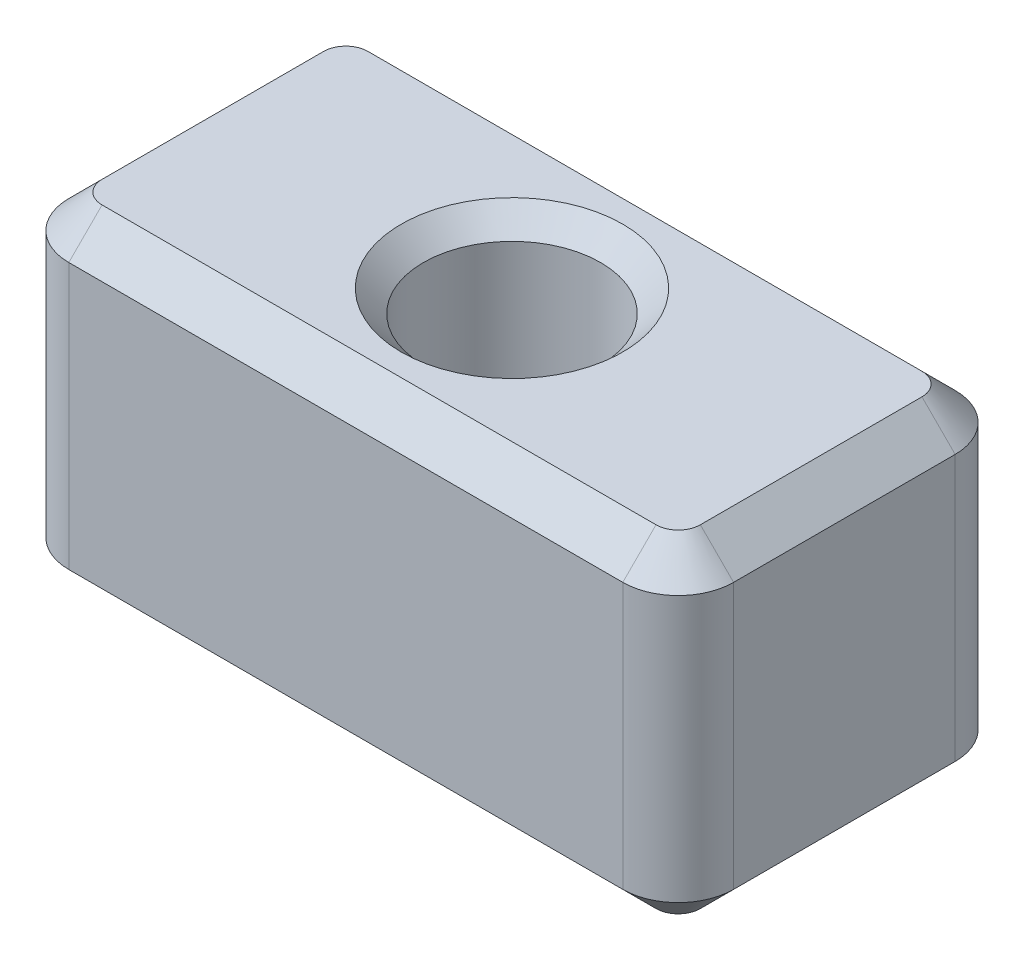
ISO-10303-21;
HEADER;
FILE_DESCRIPTION(('STEP AP214'),'2;1');
FILE_NAME('part.step','',(''),(''),'','','');
FILE_SCHEMA(('AUTOMOTIVE_DESIGN { 1 0 10303 214 1 1 1 1 }'));
ENDSEC;
DATA;
#1=APPLICATION_CONTEXT('core data for automotive mechanical design processes');
#2=APPLICATION_PROTOCOL_DEFINITION('international standard','automotive_design',2000,#1);
#3=PRODUCT_CONTEXT('',#1,'mechanical');
#4=PRODUCT('Part','Part','',(#3));
#5=PRODUCT_RELATED_PRODUCT_CATEGORY('part','',(#4));
#6=PRODUCT_DEFINITION_FORMATION('','',#4);
#7=PRODUCT_DEFINITION_CONTEXT('part definition',#1,'design');
#8=PRODUCT_DEFINITION('design','',#6,#7);
#9=PRODUCT_DEFINITION_SHAPE('','',#8);
#10=(LENGTH_UNIT() NAMED_UNIT(*) SI_UNIT(.MILLI.,.METRE.));
#11=(NAMED_UNIT(*) PLANE_ANGLE_UNIT() SI_UNIT($,.RADIAN.));
#12=(NAMED_UNIT(*) SI_UNIT($,.STERADIAN.) SOLID_ANGLE_UNIT());
#13=UNCERTAINTY_MEASURE_WITH_UNIT(LENGTH_MEASURE(1.E-05),#10,'distance_accuracy_value','');
#14=(GEOMETRIC_REPRESENTATION_CONTEXT(3) GLOBAL_UNCERTAINTY_ASSIGNED_CONTEXT((#13)) GLOBAL_UNIT_ASSIGNED_CONTEXT((#10,
#11,#12)) REPRESENTATION_CONTEXT('',''));
#15=CARTESIAN_POINT('',(0.,0.,0.));
#16=DIRECTION('',(0.,0.,1.));
#17=DIRECTION('',(1.,0.,0.));
#18=AXIS2_PLACEMENT_3D('',#15,#16,#17);
#19=CARTESIAN_POINT('',(53.,-5.4,0.15));
#20=DIRECTION('',(-1.,0.,0.));
#21=DIRECTION('',(0.,0.,1.));
#22=AXIS2_PLACEMENT_3D('',#19,#20,#21);
#23=PLANE('',#22);
#24=DIRECTION('',(0.,1.,0.));
#25=VECTOR('',#24,1.);
#26=CARTESIAN_POINT('',(53.,-5.4,2.65));
#27=LINE('',#26,#25);
#28=CARTESIAN_POINT('',(53.,-5.1,2.65));
#29=VERTEX_POINT('',#28);
#30=CARTESIAN_POINT('',(53.,-2.70000000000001,2.65));
#31=VERTEX_POINT('',#30);
#32=EDGE_CURVE('E560',#29,#31,#27,.T.);
#33=ORIENTED_EDGE('',*,*,#32,.T.);
#34=DIRECTION('',(0.,0.,-1.));
#35=VECTOR('',#34,1.);
#36=CARTESIAN_POINT('',(53.,-2.70000000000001,0.15));
#37=LINE('',#36,#35);
#38=CARTESIAN_POINT('',(53.,-2.70000000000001,0.65));
#39=VERTEX_POINT('',#38);
#40=EDGE_CURVE('E519',#31,#39,#37,.T.);
#41=ORIENTED_EDGE('',*,*,#40,.T.);
#42=DIRECTION('',(0.,1.,0.));
#43=VECTOR('',#42,1.);
#44=CARTESIAN_POINT('',(53.,-5.4,0.65));
#45=LINE('',#44,#43);
#46=CARTESIAN_POINT('',(53.,-5.1,0.65));
#47=VERTEX_POINT('',#46);
#48=EDGE_CURVE('E551',#39,#47,#45,.F.);
#49=ORIENTED_EDGE('',*,*,#48,.T.);
#50=DIRECTION('',(0.,0.,1.));
#51=VECTOR('',#50,1.);
#52=CARTESIAN_POINT('',(53.,-5.1,2.65));
#53=LINE('',#52,#51);
#54=EDGE_CURVE('E510',#47,#29,#53,.T.);
#55=ORIENTED_EDGE('',*,*,#54,.T.);
#56=EDGE_LOOP('',(#33,#41,#49,#55));
#57=FACE_BOUND('',#56,.T.);
#58=ADVANCED_FACE('F222',(#57),#23,.T.);
#59=CARTESIAN_POINT('',(53.,-5.4,0.15));
#60=DIRECTION('',(0.,0.,-1.));
#61=DIRECTION('',(-1.,0.,0.));
#62=AXIS2_PLACEMENT_3D('',#59,#60,#61);
#63=PLANE('',#62);
#64=DIRECTION('',(0.,1.,0.));
#65=VECTOR('',#64,1.);
#66=CARTESIAN_POINT('',(53.5,-5.4,0.15));
#67=LINE('',#66,#65);
#68=CARTESIAN_POINT('',(53.5,-5.1,0.15));
#69=VERTEX_POINT('',#68);
#70=CARTESIAN_POINT('',(53.5,-2.70000000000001,0.15));
#71=VERTEX_POINT('',#70);
#72=EDGE_CURVE('E515',#69,#71,#67,.T.);
#73=ORIENTED_EDGE('',*,*,#72,.T.);
#74=DIRECTION('',(1.,0.,0.));
#75=VECTOR('',#74,1.);
#76=CARTESIAN_POINT('',(53.,-2.70000000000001,0.15));
#77=LINE('',#76,#75);
#78=CARTESIAN_POINT('',(58.5,-2.70000000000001,0.15));
#79=VERTEX_POINT('',#78);
#80=EDGE_CURVE('E457',#71,#79,#77,.T.);
#81=ORIENTED_EDGE('',*,*,#80,.T.);
#82=DIRECTION('',(0.,1.,0.));
#83=VECTOR('',#82,1.);
#84=CARTESIAN_POINT('',(58.5,-5.4,0.15));
#85=LINE('',#84,#83);
#86=CARTESIAN_POINT('',(58.5,-5.1,0.15));
#87=VERTEX_POINT('',#86);
#88=EDGE_CURVE('E513',#79,#87,#85,.F.);
#89=ORIENTED_EDGE('',*,*,#88,.T.);
#90=DIRECTION('',(-1.,0.,0.));
#91=VECTOR('',#90,1.);
#92=CARTESIAN_POINT('',(53.5,-5.1,0.15));
#93=LINE('',#92,#91);
#94=EDGE_CURVE('E452',#87,#69,#93,.T.);
#95=ORIENTED_EDGE('',*,*,#94,.T.);
#96=EDGE_LOOP('',(#73,#81,#89,#95));
#97=FACE_BOUND('',#96,.T.);
#98=ADVANCED_FACE('F556',(#97),#63,.T.);
#99=CARTESIAN_POINT('',(59.,-5.4,0.15));
#100=DIRECTION('',(1.,0.,0.));
#101=DIRECTION('',(0.,0.,-1.));
#102=AXIS2_PLACEMENT_3D('',#99,#100,#101);
#103=PLANE('',#102);
#104=DIRECTION('',(0.,1.,0.));
#105=VECTOR('',#104,1.);
#106=CARTESIAN_POINT('',(59.,-5.4,0.65));
#107=LINE('',#106,#105);
#108=CARTESIAN_POINT('',(59.,-5.1,0.65));
#109=VERTEX_POINT('',#108);
#110=CARTESIAN_POINT('',(59.,-2.70000000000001,0.65));
#111=VERTEX_POINT('',#110);
#112=EDGE_CURVE('E504',#109,#111,#107,.T.);
#113=ORIENTED_EDGE('',*,*,#112,.T.);
#114=DIRECTION('',(0.,0.,1.));
#115=VECTOR('',#114,1.);
#116=CARTESIAN_POINT('',(59.,-2.70000000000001,0.15));
#117=LINE('',#116,#115);
#118=CARTESIAN_POINT('',(59.,-2.70000000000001,2.65));
#119=VERTEX_POINT('',#118);
#120=EDGE_CURVE('E478',#111,#119,#117,.T.);
#121=ORIENTED_EDGE('',*,*,#120,.T.);
#122=DIRECTION('',(0.,1.,0.));
#123=VECTOR('',#122,1.);
#124=CARTESIAN_POINT('',(59.,-5.4,2.65));
#125=LINE('',#124,#123);
#126=CARTESIAN_POINT('',(59.,-5.1,2.65));
#127=VERTEX_POINT('',#126);
#128=EDGE_CURVE('E582',#119,#127,#125,.F.);
#129=ORIENTED_EDGE('',*,*,#128,.T.);
#130=DIRECTION('',(0.,0.,-1.));
#131=VECTOR('',#130,1.);
#132=CARTESIAN_POINT('',(59.,-5.1,0.65));
#133=LINE('',#132,#131);
#134=EDGE_CURVE('E476',#127,#109,#133,.T.);
#135=ORIENTED_EDGE('',*,*,#134,.T.);
#136=EDGE_LOOP('',(#113,#121,#129,#135));
#137=FACE_BOUND('',#136,.T.);
#138=ADVANCED_FACE('F577',(#137),#103,.T.);
#139=CARTESIAN_POINT('',(53.,-5.4,3.15));
#140=DIRECTION('',(0.,0.,1.));
#141=DIRECTION('',(1.,0.,0.));
#142=AXIS2_PLACEMENT_3D('',#139,#140,#141);
#143=PLANE('',#142);
#144=DIRECTION('',(0.,1.,0.));
#145=VECTOR('',#144,1.);
#146=CARTESIAN_POINT('',(58.5,-5.4,3.15));
#147=LINE('',#146,#145);
#148=CARTESIAN_POINT('',(58.5,-5.1,3.15));
#149=VERTEX_POINT('',#148);
#150=CARTESIAN_POINT('',(58.5,-2.70000000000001,3.15));
#151=VERTEX_POINT('',#150);
#152=EDGE_CURVE('E503',#149,#151,#147,.T.);
#153=ORIENTED_EDGE('',*,*,#152,.T.);
#154=DIRECTION('',(-1.,0.,0.));
#155=VECTOR('',#154,1.);
#156=CARTESIAN_POINT('',(53.,-2.70000000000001,3.15));
#157=LINE('',#156,#155);
#158=CARTESIAN_POINT('',(53.5,-2.70000000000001,3.15));
#159=VERTEX_POINT('',#158);
#160=EDGE_CURVE('E445',#151,#159,#157,.T.);
#161=ORIENTED_EDGE('',*,*,#160,.T.);
#162=DIRECTION('',(0.,1.,0.));
#163=VECTOR('',#162,1.);
#164=CARTESIAN_POINT('',(53.5,-5.4,3.15));
#165=LINE('',#164,#163);
#166=CARTESIAN_POINT('',(53.5,-5.1,3.15));
#167=VERTEX_POINT('',#166);
#168=EDGE_CURVE('E363',#159,#167,#165,.F.);
#169=ORIENTED_EDGE('',*,*,#168,.T.);
#170=DIRECTION('',(1.,0.,0.));
#171=VECTOR('',#170,1.);
#172=CARTESIAN_POINT('',(58.5,-5.1,3.15));
#173=LINE('',#172,#171);
#174=EDGE_CURVE('E453',#167,#149,#173,.T.);
#175=ORIENTED_EDGE('',*,*,#174,.T.);
#176=EDGE_LOOP('',(#153,#161,#169,#175));
#177=FACE_BOUND('',#176,.T.);
#178=ADVANCED_FACE('F623',(#177),#143,.T.);
#179=CARTESIAN_POINT('',(0.,-5.4,0.));
#180=DIRECTION('',(0.,1.,0.));
#181=DIRECTION('',(0.,0.,1.));
#182=AXIS2_PLACEMENT_3D('',#179,#180,#181);
#183=PLANE('',#182);
#184=CARTESIAN_POINT('',(53.5,-5.4,2.65));
#185=DIRECTION('',(0.,1.,0.));
#186=DIRECTION('',(0.,0.,1.));
#187=AXIS2_PLACEMENT_3D('',#184,#185,#186);
#188=CIRCLE('',#187,0.199999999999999);
#189=CARTESIAN_POINT('',(53.5,-5.4,2.85));
#190=VERTEX_POINT('',#189);
#191=CARTESIAN_POINT('',(53.3,-5.4,2.65));
#192=VERTEX_POINT('',#191);
#193=EDGE_CURVE('E232',#190,#192,#188,.F.);
#194=ORIENTED_EDGE('',*,*,#193,.T.);
#195=DIRECTION('',(0.,0.,-1.));
#196=VECTOR('',#195,1.);
#197=CARTESIAN_POINT('',(53.3,-5.4,0.65));
#198=LINE('',#197,#196);
#199=CARTESIAN_POINT('',(53.3,-5.4,0.65));
#200=VERTEX_POINT('',#199);
#201=EDGE_CURVE('E14',#192,#200,#198,.T.);
#202=ORIENTED_EDGE('',*,*,#201,.T.);
#203=CARTESIAN_POINT('',(53.5,-5.4,0.65));
#204=DIRECTION('',(0.,1.,0.));
#205=DIRECTION('',(0.,0.,1.));
#206=AXIS2_PLACEMENT_3D('',#203,#204,#205);
#207=CIRCLE('',#206,0.199999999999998);
#208=CARTESIAN_POINT('',(53.5,-5.4,0.450000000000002));
#209=VERTEX_POINT('',#208);
#210=EDGE_CURVE('E495',#200,#209,#207,.F.);
#211=ORIENTED_EDGE('',*,*,#210,.T.);
#212=DIRECTION('',(1.,0.,0.));
#213=VECTOR('',#212,1.);
#214=CARTESIAN_POINT('',(58.5,-5.4,0.450000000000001));
#215=LINE('',#214,#213);
#216=CARTESIAN_POINT('',(58.5,-5.4,0.450000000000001));
#217=VERTEX_POINT('',#216);
#218=EDGE_CURVE('E489',#209,#217,#215,.T.);
#219=ORIENTED_EDGE('',*,*,#218,.T.);
#220=CARTESIAN_POINT('',(58.5,-5.4,0.65));
#221=DIRECTION('',(0.,1.,0.));
#222=DIRECTION('',(0.,0.,1.));
#223=AXIS2_PLACEMENT_3D('',#220,#221,#222);
#224=CIRCLE('',#223,0.199999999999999);
#225=CARTESIAN_POINT('',(58.7,-5.4,0.65));
#226=VERTEX_POINT('',#225);
#227=EDGE_CURVE('E484',#217,#226,#224,.F.);
#228=ORIENTED_EDGE('',*,*,#227,.T.);
#229=DIRECTION('',(0.,0.,1.));
#230=VECTOR('',#229,1.);
#231=CARTESIAN_POINT('',(58.7,-5.4,2.65));
#232=LINE('',#231,#230);
#233=CARTESIAN_POINT('',(58.7,-5.4,2.65));
#234=VERTEX_POINT('',#233);
#235=EDGE_CURVE('E481',#226,#234,#232,.T.);
#236=ORIENTED_EDGE('',*,*,#235,.T.);
#237=CARTESIAN_POINT('',(58.5,-5.4,2.65));
#238=DIRECTION('',(0.,1.,0.));
#239=DIRECTION('',(0.,0.,1.));
#240=AXIS2_PLACEMENT_3D('',#237,#238,#239);
#241=CIRCLE('',#240,0.199999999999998);
#242=CARTESIAN_POINT('',(58.5,-5.4,2.85));
#243=VERTEX_POINT('',#242);
#244=EDGE_CURVE('E487',#234,#243,#241,.F.);
#245=ORIENTED_EDGE('',*,*,#244,.T.);
#246=DIRECTION('',(-1.,0.,0.));
#247=VECTOR('',#246,1.);
#248=CARTESIAN_POINT('',(53.5,-5.4,2.85));
#249=LINE('',#248,#247);
#250=EDGE_CURVE('E492',#243,#190,#249,.T.);
#251=ORIENTED_EDGE('',*,*,#250,.T.);
#252=EDGE_LOOP('',(#194,#202,#211,#219,#228,#236,#245,#251));
#253=FACE_BOUND('',#252,.T.);
#254=CARTESIAN_POINT('',(56.,-5.4,1.65));
#255=DIRECTION('',(0.,-1.,0.));
#256=DIRECTION('',(0.,0.,-1.));
#257=AXIS2_PLACEMENT_3D('',#254,#255,#256);
#258=CIRCLE('',#257,1.);
#259=CARTESIAN_POINT('',(56.,-5.4,0.649999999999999));
#260=VERTEX_POINT('',#259);
#261=EDGE_CURVE('E597',#260,#260,#258,.T.);
#262=ORIENTED_EDGE('',*,*,#261,.F.);
#263=EDGE_LOOP('',(#262));
#264=FACE_BOUND('',#263,.T.);
#265=ADVANCED_FACE('F621',(#253,#264),#183,.F.);
#266=CARTESIAN_POINT('',(0.,-2.4,0.));
#267=DIRECTION('',(0.,1.,0.));
#268=DIRECTION('',(0.,0.,1.));
#269=AXIS2_PLACEMENT_3D('',#266,#267,#268);
#270=PLANE('',#269);
#271=CARTESIAN_POINT('',(53.5,-2.4,0.65));
#272=DIRECTION('',(0.,1.,0.));
#273=DIRECTION('',(0.,0.,1.));
#274=AXIS2_PLACEMENT_3D('',#271,#272,#273);
#275=CIRCLE('',#274,0.199999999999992);
#276=CARTESIAN_POINT('',(53.5,-2.4,0.450000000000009));
#277=VERTEX_POINT('',#276);
#278=CARTESIAN_POINT('',(53.3,-2.4,0.65));
#279=VERTEX_POINT('',#278);
#280=EDGE_CURVE('E531',#277,#279,#275,.T.);
#281=ORIENTED_EDGE('',*,*,#280,.T.);
#282=DIRECTION('',(0.,0.,1.));
#283=VECTOR('',#282,1.);
#284=CARTESIAN_POINT('',(53.3,-2.4,0.));
#285=LINE('',#284,#283);
#286=CARTESIAN_POINT('',(53.3,-2.4,2.65));
#287=VERTEX_POINT('',#286);
#288=EDGE_CURVE('E507',#279,#287,#285,.T.);
#289=ORIENTED_EDGE('',*,*,#288,.T.);
#290=CARTESIAN_POINT('',(53.5,-2.4,2.65));
#291=DIRECTION('',(0.,1.,0.));
#292=DIRECTION('',(0.,0.,1.));
#293=AXIS2_PLACEMENT_3D('',#290,#291,#292);
#294=CIRCLE('',#293,0.199999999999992);
#295=CARTESIAN_POINT('',(53.5,-2.4,2.84999999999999));
#296=VERTEX_POINT('',#295);
#297=EDGE_CURVE('E511',#287,#296,#294,.T.);
#298=ORIENTED_EDGE('',*,*,#297,.T.);
#299=DIRECTION('',(1.,0.,0.));
#300=VECTOR('',#299,1.);
#301=CARTESIAN_POINT('',(0.,-2.4,2.85));
#302=LINE('',#301,#300);
#303=CARTESIAN_POINT('',(58.5,-2.4,2.84999999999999));
#304=VERTEX_POINT('',#303);
#305=EDGE_CURVE('E344',#296,#304,#302,.T.);
#306=ORIENTED_EDGE('',*,*,#305,.T.);
#307=CARTESIAN_POINT('',(58.5,-2.4,2.65));
#308=DIRECTION('',(0.,1.,0.));
#309=DIRECTION('',(0.,0.,1.));
#310=AXIS2_PLACEMENT_3D('',#307,#308,#309);
#311=CIRCLE('',#310,0.199999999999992);
#312=CARTESIAN_POINT('',(58.7,-2.4,2.65));
#313=VERTEX_POINT('',#312);
#314=EDGE_CURVE('E337',#304,#313,#311,.T.);
#315=ORIENTED_EDGE('',*,*,#314,.T.);
#316=DIRECTION('',(0.,0.,-1.));
#317=VECTOR('',#316,1.);
#318=CARTESIAN_POINT('',(58.7,-2.4,0.));
#319=LINE('',#318,#317);
#320=CARTESIAN_POINT('',(58.7,-2.4,0.65));
#321=VERTEX_POINT('',#320);
#322=EDGE_CURVE('E341',#313,#321,#319,.T.);
#323=ORIENTED_EDGE('',*,*,#322,.T.);
#324=CARTESIAN_POINT('',(58.5,-2.4,0.65));
#325=DIRECTION('',(0.,1.,0.));
#326=DIRECTION('',(0.,0.,1.));
#327=AXIS2_PLACEMENT_3D('',#324,#325,#326);
#328=CIRCLE('',#327,0.199999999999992);
#329=CARTESIAN_POINT('',(58.5,-2.4,0.450000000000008));
#330=VERTEX_POINT('',#329);
#331=EDGE_CURVE('E351',#321,#330,#328,.T.);
#332=ORIENTED_EDGE('',*,*,#331,.T.);
#333=DIRECTION('',(-1.,0.,0.));
#334=VECTOR('',#333,1.);
#335=CARTESIAN_POINT('',(0.,-2.4,0.450000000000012));
#336=LINE('',#335,#334);
#337=EDGE_CURVE('E350',#330,#277,#336,.T.);
#338=ORIENTED_EDGE('',*,*,#337,.T.);
#339=EDGE_LOOP('',(#281,#289,#298,#306,#315,#323,#332,#338));
#340=FACE_BOUND('',#339,.T.);
#341=CARTESIAN_POINT('',(56.,-2.4,1.65));
#342=DIRECTION('',(0.,-1.,0.));
#343=DIRECTION('',(0.,0.,-1.));
#344=AXIS2_PLACEMENT_3D('',#341,#342,#343);
#345=CIRCLE('',#344,1.);
#346=CARTESIAN_POINT('',(56.,-2.4,0.649999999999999));
#347=VERTEX_POINT('',#346);
#348=EDGE_CURVE('E373',#347,#347,#345,.T.);
#349=ORIENTED_EDGE('',*,*,#348,.T.);
#350=EDGE_LOOP('',(#349));
#351=FACE_BOUND('',#350,.T.);
#352=ADVANCED_FACE('F339',(#340,#351),#270,.T.);
#353=CARTESIAN_POINT('',(56.,-2.6,1.65));
#354=DIRECTION('',(0.,1.,0.));
#355=DIRECTION('',(0.,0.,1.));
#356=AXIS2_PLACEMENT_3D('',#353,#354,#355);
#357=CONICAL_SURFACE('',#356,0.800000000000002,0.785398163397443);
#358=ORIENTED_EDGE('',*,*,#348,.F.);
#359=EDGE_LOOP('',(#358));
#360=FACE_BOUND('',#359,.T.);
#361=CARTESIAN_POINT('',(56.,-2.6,1.65));
#362=DIRECTION('',(0.,-1.,0.));
#363=DIRECTION('',(0.,0.,-1.));
#364=AXIS2_PLACEMENT_3D('',#361,#362,#363);
#365=CIRCLE('',#364,0.800000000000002);
#366=CARTESIAN_POINT('',(56.,-2.6,0.849999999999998));
#367=VERTEX_POINT('',#366);
#368=EDGE_CURVE('E516',#367,#367,#365,.T.);
#369=ORIENTED_EDGE('',*,*,#368,.T.);
#370=EDGE_LOOP('',(#369));
#371=FACE_BOUND('',#370,.T.);
#372=ADVANCED_FACE('F603',(#360,#371),#357,.F.);
#373=CARTESIAN_POINT('',(56.,-5.4,1.65));
#374=DIRECTION('',(0.,-1.,0.));
#375=DIRECTION('',(0.,0.,-1.));
#376=AXIS2_PLACEMENT_3D('',#373,#374,#375);
#377=CYLINDRICAL_SURFACE('',#376,0.800000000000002);
#378=ORIENTED_EDGE('',*,*,#368,.F.);
#379=EDGE_LOOP('',(#378));
#380=FACE_BOUND('',#379,.T.);
#381=CARTESIAN_POINT('',(56.,-5.2,1.65));
#382=DIRECTION('',(0.,-1.,0.));
#383=DIRECTION('',(0.,0.,-1.));
#384=AXIS2_PLACEMENT_3D('',#381,#382,#383);
#385=CIRCLE('',#384,0.800000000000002);
#386=CARTESIAN_POINT('',(56.,-5.2,0.849999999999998));
#387=VERTEX_POINT('',#386);
#388=EDGE_CURVE('E593',#387,#387,#385,.T.);
#389=ORIENTED_EDGE('',*,*,#388,.T.);
#390=EDGE_LOOP('',(#389));
#391=FACE_BOUND('',#390,.T.);
#392=ADVANCED_FACE('F606',(#380,#391),#377,.F.);
#393=CARTESIAN_POINT('',(56.,-5.4,1.65));
#394=DIRECTION('',(0.,-1.,0.));
#395=DIRECTION('',(0.,0.,-1.));
#396=AXIS2_PLACEMENT_3D('',#393,#394,#395);
#397=CONICAL_SURFACE('',#396,1.,0.785398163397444);
#398=ORIENTED_EDGE('',*,*,#388,.F.);
#399=EDGE_LOOP('',(#398));
#400=FACE_BOUND('',#399,.T.);
#401=ORIENTED_EDGE('',*,*,#261,.T.);
#402=EDGE_LOOP('',(#401));
#403=FACE_BOUND('',#402,.T.);
#404=ADVANCED_FACE('F612',(#400,#403),#397,.F.);
#405=CARTESIAN_POINT('',(53.5,-5.4,0.65));
#406=DIRECTION('',(0.,1.,0.));
#407=DIRECTION('',(0.,0.,1.));
#408=AXIS2_PLACEMENT_3D('',#405,#406,#407);
#409=CYLINDRICAL_SURFACE('',#408,0.5);
#410=ORIENTED_EDGE('',*,*,#48,.F.);
#411=CARTESIAN_POINT('',(53.5,-2.70000000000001,0.65));
#412=DIRECTION('',(0.,1.,0.));
#413=DIRECTION('',(0.,0.,1.));
#414=AXIS2_PLACEMENT_3D('',#411,#412,#413);
#415=CIRCLE('',#414,0.5);
#416=EDGE_CURVE('E460',#39,#71,#415,.F.);
#417=ORIENTED_EDGE('',*,*,#416,.T.);
#418=ORIENTED_EDGE('',*,*,#72,.F.);
#419=CARTESIAN_POINT('',(53.5,-5.1,0.65));
#420=DIRECTION('',(0.,1.,0.));
#421=DIRECTION('',(0.,0.,1.));
#422=AXIS2_PLACEMENT_3D('',#419,#420,#421);
#423=CIRCLE('',#422,0.5);
#424=EDGE_CURVE('E499',#69,#47,#423,.T.);
#425=ORIENTED_EDGE('',*,*,#424,.T.);
#426=EDGE_LOOP('',(#410,#417,#418,#425));
#427=FACE_BOUND('',#426,.T.);
#428=ADVANCED_FACE('F548',(#427),#409,.T.);
#429=CARTESIAN_POINT('',(58.5,-5.4,0.65));
#430=DIRECTION('',(0.,1.,0.));
#431=DIRECTION('',(0.,0.,1.));
#432=AXIS2_PLACEMENT_3D('',#429,#430,#431);
#433=CYLINDRICAL_SURFACE('',#432,0.5);
#434=ORIENTED_EDGE('',*,*,#88,.F.);
#435=CARTESIAN_POINT('',(58.5,-2.70000000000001,0.65));
#436=DIRECTION('',(0.,1.,0.));
#437=DIRECTION('',(0.,0.,1.));
#438=AXIS2_PLACEMENT_3D('',#435,#436,#437);
#439=CIRCLE('',#438,0.5);
#440=EDGE_CURVE('E473',#79,#111,#439,.F.);
#441=ORIENTED_EDGE('',*,*,#440,.T.);
#442=ORIENTED_EDGE('',*,*,#112,.F.);
#443=CARTESIAN_POINT('',(58.5,-5.1,0.65));
#444=DIRECTION('',(0.,1.,0.));
#445=DIRECTION('',(0.,0.,1.));
#446=AXIS2_PLACEMENT_3D('',#443,#444,#445);
#447=CIRCLE('',#446,0.5);
#448=EDGE_CURVE('E470',#109,#87,#447,.T.);
#449=ORIENTED_EDGE('',*,*,#448,.T.);
#450=EDGE_LOOP('',(#434,#441,#442,#449));
#451=FACE_BOUND('',#450,.T.);
#452=ADVANCED_FACE('F575',(#451),#433,.T.);
#453=CARTESIAN_POINT('',(53.5,-5.4,2.65));
#454=DIRECTION('',(0.,1.,0.));
#455=DIRECTION('',(0.,0.,1.));
#456=AXIS2_PLACEMENT_3D('',#453,#454,#455);
#457=CYLINDRICAL_SURFACE('',#456,0.5);
#458=ORIENTED_EDGE('',*,*,#168,.F.);
#459=CARTESIAN_POINT('',(53.5,-2.70000000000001,2.65));
#460=DIRECTION('',(0.,1.,0.));
#461=DIRECTION('',(0.,0.,1.));
#462=AXIS2_PLACEMENT_3D('',#459,#460,#461);
#463=CIRCLE('',#462,0.5);
#464=EDGE_CURVE('E498',#159,#31,#463,.F.);
#465=ORIENTED_EDGE('',*,*,#464,.T.);
#466=ORIENTED_EDGE('',*,*,#32,.F.);
#467=CARTESIAN_POINT('',(53.5,-5.1,2.65));
#468=DIRECTION('',(0.,1.,0.));
#469=DIRECTION('',(0.,0.,1.));
#470=AXIS2_PLACEMENT_3D('',#467,#468,#469);
#471=CIRCLE('',#470,0.5);
#472=EDGE_CURVE('E500',#29,#167,#471,.T.);
#473=ORIENTED_EDGE('',*,*,#472,.T.);
#474=EDGE_LOOP('',(#458,#465,#466,#473));
#475=FACE_BOUND('',#474,.T.);
#476=ADVANCED_FACE('F644',(#475),#457,.T.);
#477=CARTESIAN_POINT('',(58.5,-5.4,2.65));
#478=DIRECTION('',(0.,1.,0.));
#479=DIRECTION('',(0.,0.,1.));
#480=AXIS2_PLACEMENT_3D('',#477,#478,#479);
#481=CYLINDRICAL_SURFACE('',#480,0.5);
#482=ORIENTED_EDGE('',*,*,#128,.F.);
#483=CARTESIAN_POINT('',(58.5,-2.70000000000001,2.65));
#484=DIRECTION('',(0.,1.,0.));
#485=DIRECTION('',(0.,0.,1.));
#486=AXIS2_PLACEMENT_3D('',#483,#484,#485);
#487=CIRCLE('',#486,0.5);
#488=EDGE_CURVE('E366',#119,#151,#487,.F.);
#489=ORIENTED_EDGE('',*,*,#488,.T.);
#490=ORIENTED_EDGE('',*,*,#152,.F.);
#491=CARTESIAN_POINT('',(58.5,-5.1,2.65));
#492=DIRECTION('',(0.,1.,0.));
#493=DIRECTION('',(0.,0.,1.));
#494=AXIS2_PLACEMENT_3D('',#491,#492,#493);
#495=CIRCLE('',#494,0.5);
#496=EDGE_CURVE('E466',#149,#127,#495,.T.);
#497=ORIENTED_EDGE('',*,*,#496,.T.);
#498=EDGE_LOOP('',(#482,#489,#490,#497));
#499=FACE_BOUND('',#498,.T.);
#500=ADVANCED_FACE('F647',(#499),#481,.T.);
#501=CARTESIAN_POINT('',(58.7,-2.4,0.));
#502=DIRECTION('',(-0.707106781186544,-0.707106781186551,0.));
#503=DIRECTION('',(0.,0.,-1.));
#504=AXIS2_PLACEMENT_3D('',#501,#502,#503);
#505=PLANE('',#504);
#506=DIRECTION('',(-0.707106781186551,0.707106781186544,0.));
#507=VECTOR('',#506,1.);
#508=CARTESIAN_POINT('',(59.,-2.70000000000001,2.65));
#509=LINE('',#508,#507);
#510=EDGE_CURVE('E357',#119,#313,#509,.T.);
#511=ORIENTED_EDGE('',*,*,#510,.F.);
#512=ORIENTED_EDGE('',*,*,#120,.F.);
#513=DIRECTION('',(0.707106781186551,-0.707106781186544,0.));
#514=VECTOR('',#513,1.);
#515=CARTESIAN_POINT('',(58.7,-2.4,0.65));
#516=LINE('',#515,#514);
#517=EDGE_CURVE('E360',#321,#111,#516,.T.);
#518=ORIENTED_EDGE('',*,*,#517,.F.);
#519=ORIENTED_EDGE('',*,*,#322,.F.);
#520=EDGE_LOOP('',(#511,#512,#518,#519));
#521=FACE_BOUND('',#520,.T.);
#522=ADVANCED_FACE('F355',(#521),#505,.F.);
#523=CARTESIAN_POINT('',(58.5,-2.4,0.65));
#524=DIRECTION('',(0.,-1.,0.));
#525=DIRECTION('',(0.,0.,-1.));
#526=AXIS2_PLACEMENT_3D('',#523,#524,#525);
#527=CONICAL_SURFACE('',#526,0.199999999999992,0.785398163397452);
#528=ORIENTED_EDGE('',*,*,#517,.T.);
#529=ORIENTED_EDGE('',*,*,#440,.F.);
#530=DIRECTION('',(0.,-0.707106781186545,-0.70710678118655));
#531=VECTOR('',#530,1.);
#532=CARTESIAN_POINT('',(58.5,-2.4,0.450000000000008));
#533=LINE('',#532,#531);
#534=EDGE_CURVE('E368',#330,#79,#533,.T.);
#535=ORIENTED_EDGE('',*,*,#534,.F.);
#536=ORIENTED_EDGE('',*,*,#331,.F.);
#537=EDGE_LOOP('',(#528,#529,#535,#536));
#538=FACE_BOUND('',#537,.T.);
#539=ADVANCED_FACE('F571',(#538),#527,.T.);
#540=CARTESIAN_POINT('',(58.5,-2.4,2.65));
#541=DIRECTION('',(0.,-1.,0.));
#542=DIRECTION('',(0.,0.,-1.));
#543=AXIS2_PLACEMENT_3D('',#540,#541,#542);
#544=CONICAL_SURFACE('',#543,0.199999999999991,0.785398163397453);
#545=ORIENTED_EDGE('',*,*,#510,.T.);
#546=ORIENTED_EDGE('',*,*,#314,.F.);
#547=DIRECTION('',(0.,0.707106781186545,-0.70710678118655));
#548=VECTOR('',#547,1.);
#549=CARTESIAN_POINT('',(58.5,-2.70000000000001,3.15));
#550=LINE('',#549,#548);
#551=EDGE_CURVE('E377',#151,#304,#550,.T.);
#552=ORIENTED_EDGE('',*,*,#551,.F.);
#553=ORIENTED_EDGE('',*,*,#488,.F.);
#554=EDGE_LOOP('',(#545,#546,#552,#553));
#555=FACE_BOUND('',#554,.T.);
#556=ADVANCED_FACE('F365',(#555),#544,.T.);
#557=CARTESIAN_POINT('',(0.,-2.4,0.450000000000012));
#558=DIRECTION('',(0.,-0.707106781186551,0.707106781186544));
#559=DIRECTION('',(-1.,0.,0.));
#560=AXIS2_PLACEMENT_3D('',#557,#558,#559);
#561=PLANE('',#560);
#562=ORIENTED_EDGE('',*,*,#534,.T.);
#563=ORIENTED_EDGE('',*,*,#80,.F.);
#564=DIRECTION('',(0.,-0.707106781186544,-0.707106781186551));
#565=VECTOR('',#564,1.);
#566=CARTESIAN_POINT('',(53.5,-2.4,0.450000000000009));
#567=LINE('',#566,#565);
#568=EDGE_CURVE('E435',#277,#71,#567,.T.);
#569=ORIENTED_EDGE('',*,*,#568,.F.);
#570=ORIENTED_EDGE('',*,*,#337,.F.);
#571=EDGE_LOOP('',(#562,#563,#569,#570));
#572=FACE_BOUND('',#571,.T.);
#573=ADVANCED_FACE('F564',(#572),#561,.F.);
#574=CARTESIAN_POINT('',(0.,-2.4,2.85));
#575=DIRECTION('',(0.,-0.70710678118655,-0.707106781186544));
#576=DIRECTION('',(1.,0.,0.));
#577=AXIS2_PLACEMENT_3D('',#574,#575,#576);
#578=PLANE('',#577);
#579=ORIENTED_EDGE('',*,*,#551,.T.);
#580=ORIENTED_EDGE('',*,*,#305,.F.);
#581=DIRECTION('',(0.,0.707106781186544,-0.707106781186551));
#582=VECTOR('',#581,1.);
#583=CARTESIAN_POINT('',(53.5,-2.70000000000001,3.15));
#584=LINE('',#583,#582);
#585=EDGE_CURVE('E428',#159,#296,#584,.T.);
#586=ORIENTED_EDGE('',*,*,#585,.F.);
#587=ORIENTED_EDGE('',*,*,#160,.F.);
#588=EDGE_LOOP('',(#579,#580,#586,#587));
#589=FACE_BOUND('',#588,.T.);
#590=ADVANCED_FACE('F443',(#589),#578,.F.);
#591=CARTESIAN_POINT('',(53.5,-2.4,0.65));
#592=DIRECTION('',(0.,-1.,0.));
#593=DIRECTION('',(0.,0.,-1.));
#594=AXIS2_PLACEMENT_3D('',#591,#592,#593);
#595=CONICAL_SURFACE('',#594,0.199999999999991,0.785398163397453);
#596=ORIENTED_EDGE('',*,*,#568,.T.);
#597=ORIENTED_EDGE('',*,*,#416,.F.);
#598=DIRECTION('',(-0.707106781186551,-0.707106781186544,0.));
#599=VECTOR('',#598,1.);
#600=CARTESIAN_POINT('',(53.3,-2.4,0.65));
#601=LINE('',#600,#599);
#602=EDGE_CURVE('E418',#279,#39,#601,.T.);
#603=ORIENTED_EDGE('',*,*,#602,.F.);
#604=ORIENTED_EDGE('',*,*,#280,.F.);
#605=EDGE_LOOP('',(#596,#597,#603,#604));
#606=FACE_BOUND('',#605,.T.);
#607=ADVANCED_FACE('F568',(#606),#595,.T.);
#608=CARTESIAN_POINT('',(53.5,-2.4,2.65));
#609=DIRECTION('',(0.,-1.,0.));
#610=DIRECTION('',(0.,0.,-1.));
#611=AXIS2_PLACEMENT_3D('',#608,#609,#610);
#612=CONICAL_SURFACE('',#611,0.199999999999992,0.785398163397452);
#613=ORIENTED_EDGE('',*,*,#585,.T.);
#614=ORIENTED_EDGE('',*,*,#297,.F.);
#615=DIRECTION('',(0.707106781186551,0.707106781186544,0.));
#616=VECTOR('',#615,1.);
#617=CARTESIAN_POINT('',(53.,-2.70000000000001,2.65));
#618=LINE('',#617,#616);
#619=EDGE_CURVE('E410',#31,#287,#618,.T.);
#620=ORIENTED_EDGE('',*,*,#619,.F.);
#621=ORIENTED_EDGE('',*,*,#464,.F.);
#622=EDGE_LOOP('',(#613,#614,#620,#621));
#623=FACE_BOUND('',#622,.T.);
#624=ADVANCED_FACE('F655',(#623),#612,.T.);
#625=CARTESIAN_POINT('',(53.3,-2.4,0.));
#626=DIRECTION('',(0.707106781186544,-0.707106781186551,0.));
#627=DIRECTION('',(0.,0.,1.));
#628=AXIS2_PLACEMENT_3D('',#625,#626,#627);
#629=PLANE('',#628);
#630=ORIENTED_EDGE('',*,*,#602,.T.);
#631=ORIENTED_EDGE('',*,*,#40,.F.);
#632=ORIENTED_EDGE('',*,*,#619,.T.);
#633=ORIENTED_EDGE('',*,*,#288,.F.);
#634=EDGE_LOOP('',(#630,#631,#632,#633));
#635=FACE_BOUND('',#634,.T.);
#636=ADVANCED_FACE('F652',(#635),#629,.F.);
#637=CARTESIAN_POINT('',(59.,-5.1,0.15));
#638=DIRECTION('',(0.707106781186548,-0.707106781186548,0.));
#639=DIRECTION('',(0.,0.,1.));
#640=AXIS2_PLACEMENT_3D('',#637,#638,#639);
#641=PLANE('',#640);
#642=DIRECTION('',(0.707106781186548,0.707106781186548,0.));
#643=VECTOR('',#642,1.);
#644=CARTESIAN_POINT('',(58.7,-5.4,2.65));
#645=LINE('',#644,#643);
#646=EDGE_CURVE('E400',#234,#127,#645,.T.);
#647=ORIENTED_EDGE('',*,*,#646,.F.);
#648=ORIENTED_EDGE('',*,*,#235,.F.);
#649=DIRECTION('',(-0.707106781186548,-0.707106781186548,0.));
#650=VECTOR('',#649,1.);
#651=CARTESIAN_POINT('',(59.,-5.1,0.65));
#652=LINE('',#651,#650);
#653=EDGE_CURVE('E226',#109,#226,#652,.T.);
#654=ORIENTED_EDGE('',*,*,#653,.F.);
#655=ORIENTED_EDGE('',*,*,#134,.F.);
#656=EDGE_LOOP('',(#647,#648,#654,#655));
#657=FACE_BOUND('',#656,.T.);
#658=ADVANCED_FACE('F224',(#657),#641,.T.);
#659=CARTESIAN_POINT('',(58.5,-5.4,0.65));
#660=DIRECTION('',(0.,1.,0.));
#661=DIRECTION('',(0.,0.,1.));
#662=AXIS2_PLACEMENT_3D('',#659,#660,#661);
#663=CONICAL_SURFACE('',#662,0.199999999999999,0.785398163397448);
#664=ORIENTED_EDGE('',*,*,#653,.T.);
#665=ORIENTED_EDGE('',*,*,#227,.F.);
#666=DIRECTION('',(0.,-0.707106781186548,0.707106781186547));
#667=VECTOR('',#666,1.);
#668=CARTESIAN_POINT('',(58.5,-5.1,0.15));
#669=LINE('',#668,#667);
#670=EDGE_CURVE('E397',#87,#217,#669,.T.);
#671=ORIENTED_EDGE('',*,*,#670,.F.);
#672=ORIENTED_EDGE('',*,*,#448,.F.);
#673=EDGE_LOOP('',(#664,#665,#671,#672));
#674=FACE_BOUND('',#673,.T.);
#675=ADVANCED_FACE('F692',(#674),#663,.T.);
#676=CARTESIAN_POINT('',(58.5,-5.4,2.65));
#677=DIRECTION('',(0.,1.,0.));
#678=DIRECTION('',(0.,0.,1.));
#679=AXIS2_PLACEMENT_3D('',#676,#677,#678);
#680=CONICAL_SURFACE('',#679,0.199999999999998,0.785398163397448);
#681=ORIENTED_EDGE('',*,*,#646,.T.);
#682=ORIENTED_EDGE('',*,*,#496,.F.);
#683=DIRECTION('',(0.,0.707106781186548,0.707106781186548));
#684=VECTOR('',#683,1.);
#685=CARTESIAN_POINT('',(58.5,-5.4,2.85));
#686=LINE('',#685,#684);
#687=EDGE_CURVE('E393',#243,#149,#686,.T.);
#688=ORIENTED_EDGE('',*,*,#687,.F.);
#689=ORIENTED_EDGE('',*,*,#244,.F.);
#690=EDGE_LOOP('',(#681,#682,#688,#689));
#691=FACE_BOUND('',#690,.T.);
#692=ADVANCED_FACE('F689',(#691),#680,.T.);
#693=CARTESIAN_POINT('',(53.,-5.1,0.15));
#694=DIRECTION('',(0.,-0.707106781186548,-0.707106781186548));
#695=DIRECTION('',(1.,0.,0.));
#696=AXIS2_PLACEMENT_3D('',#693,#694,#695);
#697=PLANE('',#696);
#698=ORIENTED_EDGE('',*,*,#670,.T.);
#699=ORIENTED_EDGE('',*,*,#218,.F.);
#700=DIRECTION('',(0.,-0.707106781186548,0.707106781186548));
#701=VECTOR('',#700,1.);
#702=CARTESIAN_POINT('',(53.5,-5.1,0.15));
#703=LINE('',#702,#701);
#704=EDGE_CURVE('E390',#69,#209,#703,.T.);
#705=ORIENTED_EDGE('',*,*,#704,.F.);
#706=ORIENTED_EDGE('',*,*,#94,.F.);
#707=EDGE_LOOP('',(#698,#699,#705,#706));
#708=FACE_BOUND('',#707,.T.);
#709=ADVANCED_FACE('F685',(#708),#697,.T.);
#710=CARTESIAN_POINT('',(53.,-5.1,3.15));
#711=DIRECTION('',(0.,-0.707106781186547,0.707106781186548));
#712=DIRECTION('',(-1.,0.,0.));
#713=AXIS2_PLACEMENT_3D('',#710,#711,#712);
#714=PLANE('',#713);
#715=ORIENTED_EDGE('',*,*,#687,.T.);
#716=ORIENTED_EDGE('',*,*,#174,.F.);
#717=DIRECTION('',(0.,0.707106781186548,0.707106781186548));
#718=VECTOR('',#717,1.);
#719=CARTESIAN_POINT('',(53.5,-5.4,2.85));
#720=LINE('',#719,#718);
#721=EDGE_CURVE('E386',#190,#167,#720,.T.);
#722=ORIENTED_EDGE('',*,*,#721,.F.);
#723=ORIENTED_EDGE('',*,*,#250,.F.);
#724=EDGE_LOOP('',(#715,#716,#722,#723));
#725=FACE_BOUND('',#724,.T.);
#726=ADVANCED_FACE('F681',(#725),#714,.T.);
#727=CARTESIAN_POINT('',(53.5,-5.4,0.65));
#728=DIRECTION('',(0.,1.,0.));
#729=DIRECTION('',(0.,0.,1.));
#730=AXIS2_PLACEMENT_3D('',#727,#728,#729);
#731=CONICAL_SURFACE('',#730,0.199999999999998,0.785398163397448);
#732=ORIENTED_EDGE('',*,*,#704,.T.);
#733=ORIENTED_EDGE('',*,*,#210,.F.);
#734=DIRECTION('',(0.707106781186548,-0.707106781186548,0.));
#735=VECTOR('',#734,1.);
#736=CARTESIAN_POINT('',(53.,-5.1,0.65));
#737=LINE('',#736,#735);
#738=EDGE_CURVE('E245',#47,#200,#737,.T.);
#739=ORIENTED_EDGE('',*,*,#738,.F.);
#740=ORIENTED_EDGE('',*,*,#424,.F.);
#741=EDGE_LOOP('',(#732,#733,#739,#740));
#742=FACE_BOUND('',#741,.T.);
#743=ADVANCED_FACE('F677',(#742),#731,.T.);
#744=CARTESIAN_POINT('',(53.5,-5.4,2.65));
#745=DIRECTION('',(0.,1.,0.));
#746=DIRECTION('',(0.,0.,1.));
#747=AXIS2_PLACEMENT_3D('',#744,#745,#746);
#748=CONICAL_SURFACE('',#747,0.199999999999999,0.785398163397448);
#749=ORIENTED_EDGE('',*,*,#721,.T.);
#750=ORIENTED_EDGE('',*,*,#472,.F.);
#751=DIRECTION('',(-0.707106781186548,0.707106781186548,0.));
#752=VECTOR('',#751,1.);
#753=CARTESIAN_POINT('',(53.3,-5.4,2.65));
#754=LINE('',#753,#752);
#755=EDGE_CURVE('E381',#192,#29,#754,.T.);
#756=ORIENTED_EDGE('',*,*,#755,.F.);
#757=ORIENTED_EDGE('',*,*,#193,.F.);
#758=EDGE_LOOP('',(#749,#750,#756,#757));
#759=FACE_BOUND('',#758,.T.);
#760=ADVANCED_FACE('F674',(#759),#748,.T.);
#761=CARTESIAN_POINT('',(53.,-5.1,0.15));
#762=DIRECTION('',(-0.707106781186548,-0.707106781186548,0.));
#763=DIRECTION('',(0.,0.,-1.));
#764=AXIS2_PLACEMENT_3D('',#761,#762,#763);
#765=PLANE('',#764);
#766=ORIENTED_EDGE('',*,*,#738,.T.);
#767=ORIENTED_EDGE('',*,*,#201,.F.);
#768=ORIENTED_EDGE('',*,*,#755,.T.);
#769=ORIENTED_EDGE('',*,*,#54,.F.);
#770=EDGE_LOOP('',(#766,#767,#768,#769));
#771=FACE_BOUND('',#770,.T.);
#772=ADVANCED_FACE('F671',(#771),#765,.T.);
#773=CLOSED_SHELL('',(#58,#98,#138,#178,#265,#352,#372,#392,#404,#428,#452,#476,#500,#522,#539,
#556,#573,#590,#607,#624,#636,#658,#675,#692,#709,#726,#743,#760,#772));
#774=MANIFOLD_SOLID_BREP('B2',#773);
#775=ADVANCED_BREP_SHAPE_REPRESENTATION('',(#18,#774),#14);
#776=SHAPE_DEFINITION_REPRESENTATION(#9,#775);
ENDSEC;
END-ISO-10303-21;
